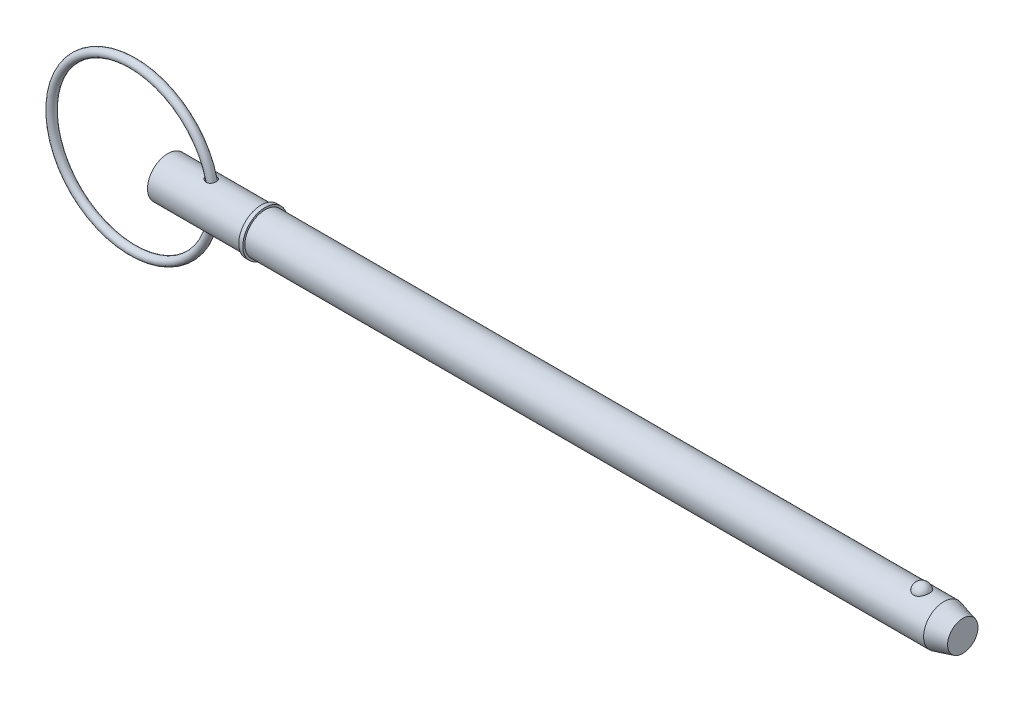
ISO-10303-21;
HEADER;
FILE_DESCRIPTION(('STEP AP214'),'2;1');
FILE_NAME('part.step','',(''),(''),'','','');
FILE_SCHEMA(('AUTOMOTIVE_DESIGN { 1 0 10303 214 1 1 1 1 }'));
ENDSEC;
DATA;
#1=APPLICATION_CONTEXT('core data for automotive mechanical design processes');
#2=APPLICATION_PROTOCOL_DEFINITION('international standard','automotive_design',2000,#1);
#3=PRODUCT_CONTEXT('',#1,'mechanical');
#4=PRODUCT('Part','Part','',(#3));
#5=PRODUCT_RELATED_PRODUCT_CATEGORY('part','',(#4));
#6=PRODUCT_DEFINITION_FORMATION('','',#4);
#7=PRODUCT_DEFINITION_CONTEXT('part definition',#1,'design');
#8=PRODUCT_DEFINITION('design','',#6,#7);
#9=PRODUCT_DEFINITION_SHAPE('','',#8);
#10=(LENGTH_UNIT() NAMED_UNIT(*) SI_UNIT(.MILLI.,.METRE.));
#11=(NAMED_UNIT(*) PLANE_ANGLE_UNIT() SI_UNIT($,.RADIAN.));
#12=(NAMED_UNIT(*) SI_UNIT($,.STERADIAN.) SOLID_ANGLE_UNIT());
#13=UNCERTAINTY_MEASURE_WITH_UNIT(LENGTH_MEASURE(1.E-05),#10,'distance_accuracy_value','');
#14=(GEOMETRIC_REPRESENTATION_CONTEXT(3) GLOBAL_UNCERTAINTY_ASSIGNED_CONTEXT((#13)) GLOBAL_UNIT_ASSIGNED_CONTEXT((#10,
#11,#12)) REPRESENTATION_CONTEXT('',''));
#15=CARTESIAN_POINT('',(0.,0.,0.));
#16=DIRECTION('',(0.,0.,1.));
#17=DIRECTION('',(1.,0.,0.));
#18=AXIS2_PLACEMENT_3D('',#15,#16,#17);
#19=CARTESIAN_POINT('',(-6.86864682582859,0.,0.));
#20=DIRECTION('',(0.,0.,1.));
#21=DIRECTION('',(1.,0.,0.));
#22=AXIS2_PLACEMENT_3D('',#19,#20,#21);
#23=TOROIDAL_SURFACE('',#22,15.875,0.794);
#24=CARTESIAN_POINT('',(9.80035317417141,0.,0.));
#25=VERTEX_POINT('',#24);
#26=VERTEX_LOOP('',#25);
#27=FACE_BOUND('',#26,.T.);
#28=ADVANCED_FACE('P0_F12',(#27),#23,.T.);
#29=CLOSED_SHELL('',(#28));
#30=MANIFOLD_SOLID_BREP('P0_B1',#29);
#31=CARTESIAN_POINT('',(0.,0.,0.));
#32=DIRECTION('',(1.,0.,0.));
#33=DIRECTION('',(0.,0.,-1.));
#34=AXIS2_PLACEMENT_3D('',#31,#32,#33);
#35=CYLINDRICAL_SURFACE('',#34,3.97);
#36=CARTESIAN_POINT('',(7.49679817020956,3.96502331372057,-0.198721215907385));
#37=CARTESIAN_POINT('',(7.50881508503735,3.96235594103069,-0.251916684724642));
#38=CARTESIAN_POINT('',(7.52561550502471,3.95866151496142,-0.304017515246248));
#39=CARTESIAN_POINT('',(7.56786984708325,3.9496659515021,-0.40447153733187));
#40=CARTESIAN_POINT('',(7.59333797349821,3.94436217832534,-0.452818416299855));
#41=CARTESIAN_POINT('',(7.65162192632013,3.93277091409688,-0.544364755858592));
#42=CARTESIAN_POINT('',(7.68440149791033,3.92648832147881,-0.587588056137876));
#43=CARTESIAN_POINT('',(7.75622109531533,3.91354812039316,-0.668369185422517));
#44=CARTESIAN_POINT('',(7.79526077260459,3.90689053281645,-0.705927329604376));
#45=CARTESIAN_POINT('',(7.88192852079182,3.8932854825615,-0.777603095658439));
#46=CARTESIAN_POINT('',(7.92999678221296,3.88635845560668,-0.811192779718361));
#47=CARTESIAN_POINT('',(8.03094744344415,3.87352417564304,-0.870420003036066));
#48=CARTESIAN_POINT('',(8.08383192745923,3.86761736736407,-0.896054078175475));
#49=CARTESIAN_POINT('',(8.19632733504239,3.85719062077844,-0.939958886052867));
#50=CARTESIAN_POINT('',(8.25615064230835,3.85277154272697,-0.957713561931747));
#51=CARTESIAN_POINT('',(8.37807849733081,3.84644428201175,-0.982821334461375));
#52=CARTESIAN_POINT('',(8.44018249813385,3.84453550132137,-0.990176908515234));
#53=CARTESIAN_POINT('',(8.56256649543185,3.84359535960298,-0.993820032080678));
#54=CARTESIAN_POINT('',(8.62283390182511,3.84446524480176,-0.990487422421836));
#55=CARTESIAN_POINT('',(8.74175397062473,3.84884648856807,-0.973323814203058));
#56=CARTESIAN_POINT('',(8.8004073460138,3.85235666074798,-0.959497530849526));
#57=CARTESIAN_POINT('',(8.91034168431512,3.86130428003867,-0.922798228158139));
#58=CARTESIAN_POINT('',(8.96185380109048,3.86659969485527,-0.900580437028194));
#59=CARTESIAN_POINT('',(9.06016940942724,3.87853590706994,-0.847697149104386));
#60=CARTESIAN_POINT('',(9.10697344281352,3.88517654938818,-0.817032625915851));
#61=CARTESIAN_POINT('',(9.19340982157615,3.89885483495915,-0.748999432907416));
#62=CARTESIAN_POINT('',(9.23319345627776,3.90587821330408,-0.711819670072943));
#63=CARTESIAN_POINT('',(9.30598310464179,3.91969783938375,-0.631295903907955));
#64=CARTESIAN_POINT('',(9.33898892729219,3.92649408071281,-0.587951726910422));
#65=CARTESIAN_POINT('',(9.39769437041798,3.939185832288,-0.495874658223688));
#66=CARTESIAN_POINT('',(9.42332322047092,3.94507238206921,-0.447095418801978));
#67=CARTESIAN_POINT('',(9.46625710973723,3.9552342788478,-0.345845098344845));
#68=CARTESIAN_POINT('',(9.48356178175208,3.95950955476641,-0.293373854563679));
#69=CARTESIAN_POINT('',(9.50956700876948,3.96602451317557,-0.185698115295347));
#70=CARTESIAN_POINT('',(9.51818595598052,3.96824487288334,-0.13047272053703));
#71=CARTESIAN_POINT('',(9.52633336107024,3.97034220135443,-0.0193113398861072));
#72=CARTESIAN_POINT('',(9.52586171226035,3.97021914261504,0.0366246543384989));
#73=CARTESIAN_POINT('',(9.51583327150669,3.9676413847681,0.147685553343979));
#74=CARTESIAN_POINT('',(9.50626624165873,3.96518405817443,0.202809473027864));
#75=CARTESIAN_POINT('',(9.47825604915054,3.95819854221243,0.310618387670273));
#76=CARTESIAN_POINT('',(9.45981267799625,3.95367030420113,0.36330332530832));
#77=CARTESIAN_POINT('',(9.41448405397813,3.94303435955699,0.464739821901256));
#78=CARTESIAN_POINT('',(9.38759833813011,3.93692656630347,0.51349116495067));
#79=CARTESIAN_POINT('',(9.32603556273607,3.92380455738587,0.605663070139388));
#80=CARTESIAN_POINT('',(9.29135869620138,3.91679036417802,0.649083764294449));
#81=CARTESIAN_POINT('',(9.21526329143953,3.90267522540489,0.729160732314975));
#82=CARTESIAN_POINT('',(9.17387556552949,3.89557480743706,0.765846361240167));
#83=CARTESIAN_POINT('',(9.08536362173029,3.88206315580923,0.831635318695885));
#84=CARTESIAN_POINT('',(9.03824022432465,3.8756518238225,0.860739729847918));
#85=CARTESIAN_POINT('',(8.94022154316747,3.86431915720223,0.910262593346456));
#86=CARTESIAN_POINT('',(8.88938101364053,3.85938013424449,0.930785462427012));
#87=CARTESIAN_POINT('',(8.78488780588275,3.85141510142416,0.96321476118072));
#88=CARTESIAN_POINT('',(8.73123520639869,3.84838903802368,0.975121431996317));
#89=CARTESIAN_POINT('',(8.62249427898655,3.84453017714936,0.990226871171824));
#90=CARTESIAN_POINT('',(8.56740225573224,3.84370373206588,0.993400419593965));
#91=CARTESIAN_POINT('',(8.45741104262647,3.8442816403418,0.991160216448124));
#92=CARTESIAN_POINT('',(8.40251189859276,3.84568649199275,0.98574454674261));
#93=CARTESIAN_POINT('',(8.29176880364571,3.85062289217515,0.966285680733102));
#94=CARTESIAN_POINT('',(8.23599684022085,3.85424894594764,0.951858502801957));
#95=CARTESIAN_POINT('',(8.12747212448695,3.86325492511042,0.91461785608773));
#96=CARTESIAN_POINT('',(8.0747205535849,3.86863553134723,0.891801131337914));
#97=CARTESIAN_POINT('',(7.97015235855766,3.88095261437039,0.836633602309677));
#98=CARTESIAN_POINT('',(7.91862083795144,3.88796764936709,0.803758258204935));
#99=CARTESIAN_POINT('',(7.82179253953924,3.90250904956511,0.729888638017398));
#100=CARTESIAN_POINT('',(7.77649765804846,3.91003556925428,0.688891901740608));
#101=CARTESIAN_POINT('',(7.69332536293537,3.92478114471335,0.599225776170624));
#102=CARTESIAN_POINT('',(7.6555122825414,3.93199714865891,0.550495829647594));
#103=CARTESIAN_POINT('',(7.5894819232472,3.94512912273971,0.446741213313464));
#104=CARTESIAN_POINT('',(7.56125849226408,3.95104592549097,0.391720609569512));
#105=CARTESIAN_POINT('',(7.51806227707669,3.9603062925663,0.282172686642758));
#106=CARTESIAN_POINT('',(7.50213211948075,3.96383230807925,0.228039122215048));
#107=CARTESIAN_POINT('',(7.48057398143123,3.96863642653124,0.117706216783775));
#108=CARTESIAN_POINT('',(7.47492746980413,3.96991857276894,0.0615107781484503));
#109=CARTESIAN_POINT('',(7.47437932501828,3.97004395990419,-0.0289758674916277));
#110=CARTESIAN_POINT('',(7.47615129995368,3.96964216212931,-0.0632805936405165));
#111=CARTESIAN_POINT('',(7.48358566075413,3.96796978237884,-0.131441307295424));
#112=CARTESIAN_POINT('',(7.48924767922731,3.96669928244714,-0.165297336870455));
#113=CARTESIAN_POINT('',(7.49679817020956,3.96502331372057,-0.198721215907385));
#114=B_SPLINE_CURVE_WITH_KNOTS('',3,(#36,#37,#38,#39,#40,#41,#42,#43,#44,#45,#46,#47,#48,#49,
#50,#51,#52,#53,#54,#55,#56,#57,#58,#59,#60,#61,#62,#63,#64,#65,#66,#67,#68,#69,#70,#71,#72,#73,
#74,#75,#76,#77,#78,#79,#80,#81,#82,#83,#84,#85,#86,#87,#88,#89,#90,#91,#92,#93,#94,#95,#96,#97,
#98,#99,#100,#101,#102,#103,#104,#105,#106,#107,#108,#109,#110,#111,#112,#113),.UNSPECIFIED.,
.T.,.F.,(4,2,2,2,2,2,2,2,2,2,2,2,2,2,2,2,2,2,2,2,2,2,2,2,2,2,2,2,2,2,2,2,2,2,2,2,2,2,4),(0.,
0.163661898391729,0.327593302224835,0.490729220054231,0.653856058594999,0.830244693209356,
1.00671002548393,1.1934572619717,1.38016000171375,1.56030212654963,1.74036335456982,
1.90857505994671,2.07676738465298,2.24071128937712,2.40465981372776,2.57013239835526,
2.73561228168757,2.90263284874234,3.06965537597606,3.23686612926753,3.40408081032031,
3.5713046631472,3.73852437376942,3.90499698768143,4.07144581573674,4.2358058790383,
4.40016134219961,4.56499094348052,4.72985735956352,4.90227873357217,5.0747670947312,
5.25849939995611,5.44228744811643,5.62759301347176,5.81277947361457,5.98144776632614,
6.14981181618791,6.25265388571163,6.35548624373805),.UNSPECIFIED.);
#115=CARTESIAN_POINT('',(7.49679817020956,3.96502331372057,-0.198721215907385));
#116=VERTEX_POINT('',#115);
#117=EDGE_CURVE('P1_E42',#116,#116,#114,.T.);
#118=ORIENTED_EDGE('',*,*,#117,.T.);
#119=EDGE_LOOP('',(#118));
#120=FACE_BOUND('',#119,.T.);
#121=CARTESIAN_POINT('',(0.,0.,0.));
#122=DIRECTION('',(1.,0.,0.));
#123=DIRECTION('',(0.,0.,-1.));
#124=AXIS2_PLACEMENT_3D('',#121,#122,#123);
#125=CIRCLE('',#124,3.97);
#126=CARTESIAN_POINT('',(0.,0.,-3.97));
#127=VERTEX_POINT('',#126);
#128=EDGE_CURVE('P1_E9',#127,#127,#125,.T.);
#129=ORIENTED_EDGE('',*,*,#128,.T.);
#130=EDGE_LOOP('',(#129));
#131=FACE_BOUND('',#130,.T.);
#132=CARTESIAN_POINT('',(18.256,0.,0.));
#133=DIRECTION('',(1.,0.,0.));
#134=DIRECTION('',(0.,0.,-1.));
#135=AXIS2_PLACEMENT_3D('',#132,#133,#134);
#136=CIRCLE('',#135,3.97);
#137=CARTESIAN_POINT('',(18.256,0.,-3.97));
#138=VERTEX_POINT('',#137);
#139=EDGE_CURVE('P1_E25',#138,#138,#136,.T.);
#140=ORIENTED_EDGE('',*,*,#139,.F.);
#141=EDGE_LOOP('',(#140));
#142=FACE_BOUND('',#141,.T.);
#143=CARTESIAN_POINT('',(7.49679817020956,-3.96502331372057,-0.198721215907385));
#144=CARTESIAN_POINT('',(7.48580986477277,-3.96746179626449,-0.150065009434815));
#145=CARTESIAN_POINT('',(7.47881617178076,-3.96904213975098,-0.100459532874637));
#146=CARTESIAN_POINT('',(7.47318383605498,-3.97031279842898,-0.000748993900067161));
#147=CARTESIAN_POINT('',(7.47454464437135,-3.97000323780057,0.049356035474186));
#148=CARTESIAN_POINT('',(7.48554252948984,-3.9675299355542,0.148550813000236));
#149=CARTESIAN_POINT('',(7.49517270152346,-3.9653677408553,0.197641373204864));
#150=CARTESIAN_POINT('',(7.5222068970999,-3.95942609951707,0.293523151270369));
#151=CARTESIAN_POINT('',(7.53961293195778,-3.9556462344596,0.340313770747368));
#152=CARTESIAN_POINT('',(7.58186218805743,-3.946757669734,0.431446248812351));
#153=CARTESIAN_POINT('',(7.6068526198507,-3.94162295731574,0.475716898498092));
#154=CARTESIAN_POINT('',(7.66318857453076,-3.93055115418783,0.559886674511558));
#155=CARTESIAN_POINT('',(7.69453617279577,-3.92461380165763,0.599784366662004));
#156=CARTESIAN_POINT('',(7.76618955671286,-3.91181958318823,0.678467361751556));
#157=CARTESIAN_POINT('',(7.80708710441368,-3.90493119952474,0.716708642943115));
#158=CARTESIAN_POINT('',(7.89431870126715,-3.89148185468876,0.786469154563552));
#159=CARTESIAN_POINT('',(7.94065563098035,-3.88492106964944,0.817984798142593));
#160=CARTESIAN_POINT('',(8.04208221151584,-3.87221514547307,0.876253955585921));
#161=CARTESIAN_POINT('',(8.09758465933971,-3.8661622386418,0.902312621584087));
#162=CARTESIAN_POINT('',(8.21228401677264,-3.855952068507,0.944996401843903));
#163=CARTESIAN_POINT('',(8.27148128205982,-3.85179498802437,0.961620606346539));
#164=CARTESIAN_POINT('',(8.39228716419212,-3.84593851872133,0.984786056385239));
#165=CARTESIAN_POINT('',(8.45390693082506,-3.84425231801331,0.991273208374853));
#166=CARTESIAN_POINT('',(8.57734686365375,-3.84370168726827,0.993408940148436));
#167=CARTESIAN_POINT('',(8.63916691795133,-3.84483588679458,0.989062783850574));
#168=CARTESIAN_POINT('',(8.75703619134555,-3.84970227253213,0.969937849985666));
#169=CARTESIAN_POINT('',(8.81320274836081,-3.85326512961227,0.955838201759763));
#170=CARTESIAN_POINT('',(8.92207486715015,-3.8624204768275,0.918140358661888));
#171=CARTESIAN_POINT('',(8.97478130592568,-3.86801245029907,0.89454458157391));
#172=CARTESIAN_POINT('',(9.07264210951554,-3.88024902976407,0.83982747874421));
#173=CARTESIAN_POINT('',(9.11803751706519,-3.88683023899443,0.809121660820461));
#174=CARTESIAN_POINT('',(9.20292513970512,-3.90048324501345,0.740506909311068));
#175=CARTESIAN_POINT('',(9.24241747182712,-3.90755503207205,0.702598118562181));
#176=CARTESIAN_POINT('',(9.31440361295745,-3.92139192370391,0.620727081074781));
#177=CARTESIAN_POINT('',(9.34691105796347,-3.9281576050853,0.576776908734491));
#178=CARTESIAN_POINT('',(9.40424150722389,-3.94066521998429,0.483990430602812));
#179=CARTESIAN_POINT('',(9.4290641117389,-3.94640710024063,0.435153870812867));
#180=CARTESIAN_POINT('',(9.47070060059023,-3.95631713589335,0.333318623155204));
#181=CARTESIAN_POINT('',(9.48741220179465,-3.96046506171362,0.280276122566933));
#182=CARTESIAN_POINT('',(9.51197570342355,-3.9666399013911,0.172058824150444));
#183=CARTESIAN_POINT('',(9.5198274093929,-3.96866676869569,0.116883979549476));
#184=CARTESIAN_POINT('',(9.52650209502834,-3.9703865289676,0.00572427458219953));
#185=CARTESIAN_POINT('',(9.52528754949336,-3.97006972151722,-0.0502629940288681));
#186=CARTESIAN_POINT('',(9.51376883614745,-3.96711300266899,-0.161232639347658));
#187=CARTESIAN_POINT('',(9.50346452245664,-3.96447305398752,-0.216214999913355));
#188=CARTESIAN_POINT('',(9.47400716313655,-3.95715440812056,-0.323616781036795));
#189=CARTESIAN_POINT('',(9.45485370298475,-3.95247561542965,-0.376036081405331));
#190=CARTESIAN_POINT('',(9.40815019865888,-3.94158766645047,-0.47682082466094));
#191=CARTESIAN_POINT('',(9.38060003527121,-3.93537848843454,-0.525186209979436));
#192=CARTESIAN_POINT('',(9.31780916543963,-3.92212278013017,-0.616423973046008));
#193=CARTESIAN_POINT('',(9.28257772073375,-3.91507726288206,-0.659302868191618));
#194=CARTESIAN_POINT('',(9.20530256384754,-3.90093459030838,-0.738394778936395));
#195=CARTESIAN_POINT('',(9.16325952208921,-3.8938374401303,-0.774608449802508));
#196=CARTESIAN_POINT('',(9.07394283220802,-3.88046830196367,-0.83901178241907));
#197=CARTESIAN_POINT('',(9.02672460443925,-3.87418889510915,-0.867276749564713));
#198=CARTESIAN_POINT('',(8.92806876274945,-3.86308015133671,-0.915492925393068));
#199=CARTESIAN_POINT('',(8.87663164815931,-3.85825064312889,-0.935445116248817));
#200=CARTESIAN_POINT('',(8.77150354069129,-3.85059630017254,-0.966469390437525));
#201=CARTESIAN_POINT('',(8.71783614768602,-3.84775433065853,-0.977617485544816));
#202=CARTESIAN_POINT('',(8.60934883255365,-3.84426767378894,-0.991239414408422));
#203=CARTESIAN_POINT('',(8.55452877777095,-3.84362324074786,-0.993712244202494));
#204=CARTESIAN_POINT('',(8.4438244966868,-3.84454392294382,-0.990144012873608));
#205=CARTESIAN_POINT('',(8.3879479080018,-3.84616465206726,-0.983888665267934));
#206=CARTESIAN_POINT('',(8.27791058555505,-3.85146784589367,-0.962917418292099));
#207=CARTESIAN_POINT('',(8.22375037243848,-3.85515092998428,-0.948198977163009));
#208=CARTESIAN_POINT('',(8.11503410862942,-3.86443542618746,-0.90964598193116));
#209=CARTESIAN_POINT('',(8.06067129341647,-3.87014379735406,-0.885291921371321));
#210=CARTESIAN_POINT('',(7.95661263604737,-3.88274545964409,-0.828274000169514));
#211=CARTESIAN_POINT('',(7.90691941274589,-3.88963940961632,-0.795605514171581));
#212=CARTESIAN_POINT('',(7.81143608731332,-3.90417480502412,-0.720990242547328));
#213=CARTESIAN_POINT('',(7.76592225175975,-3.9118359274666,-0.678692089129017));
#214=CARTESIAN_POINT('',(7.68309200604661,-3.926691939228,-0.586646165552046));
#215=CARTESIAN_POINT('',(7.6457689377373,-3.93388720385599,-0.536904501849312));
#216=CARTESIAN_POINT('',(7.58649683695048,-3.94577687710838,-0.440118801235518));
#217=CARTESIAN_POINT('',(7.56301593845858,-3.95068841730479,-0.394037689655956));
#218=CARTESIAN_POINT('',(7.52386335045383,-3.95904753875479,-0.298549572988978));
#219=CARTESIAN_POINT('',(7.5081856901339,-3.96249623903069,-0.249145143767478));
#220=CARTESIAN_POINT('',(7.49679817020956,-3.96502331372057,-0.198721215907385));
#221=B_SPLINE_CURVE_WITH_KNOTS('',3,(#143,#144,#145,#146,#147,#148,#149,#150,#151,#152,#153,
#154,#155,#156,#157,#158,#159,#160,#161,#162,#163,#164,#165,#166,#167,#168,#169,#170,#171,#172,
#173,#174,#175,#176,#177,#178,#179,#180,#181,#182,#183,#184,#185,#186,#187,#188,#189,#190,#191,
#192,#193,#194,#195,#196,#197,#198,#199,#200,#201,#202,#203,#204,#205,#206,#207,#208,#209,#210,
#211,#212,#213,#214,#215,#216,#217,#218,#219,#220),.UNSPECIFIED.,.T.,.F.,(4,2,2,2,2,2,2,2,2,2,2,
2,2,2,2,2,2,2,2,2,2,2,2,2,2,2,2,2,2,2,2,2,2,2,2,2,2,2,4),(0.,0.149644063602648,
0.299278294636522,0.448787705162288,0.598335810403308,0.750995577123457,0.903705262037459,
1.07224475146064,1.2408739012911,1.4248565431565,1.60885692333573,1.79383585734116,
1.97872492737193,2.15188813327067,2.32500727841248,2.489818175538,2.65462580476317,
2.81910871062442,2.98360017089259,3.15011526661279,3.31663401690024,3.48384236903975,
3.65105340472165,3.81827227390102,3.98549351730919,4.15251423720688,4.31951852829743,
4.48488279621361,4.65022752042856,4.81412860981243,4.97804866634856,5.14606470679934,
5.31413123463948,5.49286956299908,5.67170754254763,5.85859317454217,6.0453263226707,
6.20052601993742,6.35560677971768),.UNSPECIFIED.);
#222=CARTESIAN_POINT('',(7.49679817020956,-3.96502331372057,-0.198721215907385));
#223=VERTEX_POINT('',#222);
#224=EDGE_CURVE('P1_E17',#223,#223,#221,.T.);
#225=ORIENTED_EDGE('',*,*,#224,.T.);
#226=EDGE_LOOP('',(#225));
#227=FACE_BOUND('',#226,.T.);
#228=ADVANCED_FACE('P1_F13',(#120,#131,#142,#227),#35,.T.);
#229=CARTESIAN_POINT('',(0.,0.,0.));
#230=DIRECTION('',(1.,0.,0.));
#231=DIRECTION('',(0.,0.,-1.));
#232=AXIS2_PLACEMENT_3D('',#229,#230,#231);
#233=CYLINDRICAL_SURFACE('',#232,3.97);
#234=CARTESIAN_POINT('',(151.875939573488,0.,0.));
#235=DIRECTION('',(1.,0.,0.));
#236=DIRECTION('',(0.,0.,-1.));
#237=AXIS2_PLACEMENT_3D('',#234,#235,#236);
#238=CIRCLE('',#237,3.97);
#239=CARTESIAN_POINT('',(151.875939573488,0.,-3.97));
#240=VERTEX_POINT('',#239);
#241=EDGE_CURVE('P1_E99',#240,#240,#238,.T.);
#242=ORIENTED_EDGE('',*,*,#241,.F.);
#243=EDGE_LOOP('',(#242));
#244=FACE_BOUND('',#243,.T.);
#245=CARTESIAN_POINT('',(19.05,0.,0.));
#246=DIRECTION('',(1.,0.,0.));
#247=DIRECTION('',(0.,0.,-1.));
#248=AXIS2_PLACEMENT_3D('',#245,#246,#247);
#249=CIRCLE('',#248,3.97);
#250=CARTESIAN_POINT('',(19.05,0.,-3.97));
#251=VERTEX_POINT('',#250);
#252=EDGE_CURVE('P1_E96',#251,#251,#249,.T.);
#253=ORIENTED_EDGE('',*,*,#252,.T.);
#254=EDGE_LOOP('',(#253));
#255=FACE_BOUND('',#254,.T.);
#256=CARTESIAN_POINT('',(147.545192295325,3.65715365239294,1.54470941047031));
#257=CARTESIAN_POINT('',(147.465244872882,3.65716001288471,1.54470290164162));
#258=CARTESIAN_POINT('',(147.385165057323,3.65987074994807,1.53832549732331));
#259=CARTESIAN_POINT('',(147.227237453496,3.67042218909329,1.51297018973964));
#260=CARTESIAN_POINT('',(147.14939614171,3.67827646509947,1.4939589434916));
#261=CARTESIAN_POINT('',(146.998461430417,3.69818848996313,1.4439595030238));
#262=CARTESIAN_POINT('',(146.925356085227,3.71023513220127,1.41300293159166));
#263=CARTESIAN_POINT('',(146.785563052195,3.7372183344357,1.34000212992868));
#264=CARTESIAN_POINT('',(146.718872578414,3.75215363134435,1.29796274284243));
#265=CARTESIAN_POINT('',(146.59148864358,3.78384968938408,1.20248834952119));
#266=CARTESIAN_POINT('',(146.531029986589,3.800651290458,1.14875388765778));
#267=CARTESIAN_POINT('',(146.419694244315,3.83398532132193,1.03205417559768));
#268=CARTESIAN_POINT('',(146.368820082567,3.85051766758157,0.969086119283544));
#269=CARTESIAN_POINT('',(146.275632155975,3.88238608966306,0.832526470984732));
#270=CARTESIAN_POINT('',(146.233796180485,3.89763698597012,0.758588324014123));
#271=CARTESIAN_POINT('',(146.162510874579,3.92451063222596,0.604352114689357));
#272=CARTESIAN_POINT('',(146.133062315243,3.93613315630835,0.524053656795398));
#273=CARTESIAN_POINT('',(146.086892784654,3.95467606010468,0.358403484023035));
#274=CARTESIAN_POINT('',(146.070312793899,3.96154426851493,0.273006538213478));
#275=CARTESIAN_POINT('',(146.050756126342,3.96967008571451,0.100408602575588));
#276=CARTESIAN_POINT('',(146.047778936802,3.97092790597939,0.0132076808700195));
#277=CARTESIAN_POINT('',(146.055458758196,3.96771794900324,-0.159844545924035));
#278=CARTESIAN_POINT('',(146.066016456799,3.96329187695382,-0.245701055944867));
#279=CARTESIAN_POINT('',(146.10038009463,3.94923163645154,-0.414277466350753));
#280=CARTESIAN_POINT('',(146.124186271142,3.93959737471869,-0.496997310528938));
#281=CARTESIAN_POINT('',(146.18461142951,3.91607752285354,-0.657113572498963));
#282=CARTESIAN_POINT('',(146.221249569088,3.90218558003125,-0.734501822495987));
#283=CARTESIAN_POINT('',(146.306593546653,3.87158287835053,-0.881704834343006));
#284=CARTESIAN_POINT('',(146.355300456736,3.85487186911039,-0.951518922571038));
#285=CARTESIAN_POINT('',(146.464116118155,3.82028735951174,-1.08208159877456));
#286=CARTESIAN_POINT('',(146.524295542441,3.80240713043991,-1.14276958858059));
#287=CARTESIAN_POINT('',(146.654493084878,3.76758161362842,-1.25282437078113));
#288=CARTESIAN_POINT('',(146.724510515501,3.75063626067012,-1.30219195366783));
#289=CARTESIAN_POINT('',(146.87118160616,3.71998948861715,-1.38729709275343));
#290=CARTESIAN_POINT('',(146.947681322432,3.70623183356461,-1.42327904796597));
#291=CARTESIAN_POINT('',(147.106298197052,3.68323188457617,-1.48178996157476));
#292=CARTESIAN_POINT('',(147.1884132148,3.67398788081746,-1.50432401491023));
#293=CARTESIAN_POINT('',(147.351481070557,3.66152163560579,-1.53440939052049));
#294=CARTESIAN_POINT('',(147.432284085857,3.65801951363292,-1.54265826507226));
#295=CARTESIAN_POINT('',(147.59420850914,3.65657341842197,-1.54608423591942));
#296=CARTESIAN_POINT('',(147.675329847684,3.65862829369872,-1.54126404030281));
#297=CARTESIAN_POINT('',(147.832812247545,3.66788969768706,-1.5190847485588));
#298=CARTESIAN_POINT('',(147.909242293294,3.67492621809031,-1.50213925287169));
#299=CARTESIAN_POINT('',(148.058041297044,3.69318404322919,-1.4566698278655));
#300=CARTESIAN_POINT('',(148.130409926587,3.7044056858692,-1.42814496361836));
#301=CARTESIAN_POINT('',(148.270802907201,3.73012749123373,-1.35956319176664));
#302=CARTESIAN_POINT('',(148.338700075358,3.74469307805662,-1.31927107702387));
#303=CARTESIAN_POINT('',(148.466864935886,3.77545272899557,-1.22847440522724));
#304=CARTESIAN_POINT('',(148.527130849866,3.79164717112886,-1.1779674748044));
#305=CARTESIAN_POINT('',(148.641634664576,3.82490325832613,-1.06519260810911));
#306=CARTESIAN_POINT('',(148.695413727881,3.84196735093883,-1.00245914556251));
#307=CARTESIAN_POINT('',(148.792098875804,3.87439863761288,-0.86871586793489));
#308=CARTESIAN_POINT('',(148.835003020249,3.88976552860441,-0.797704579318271));
#309=CARTESIAN_POINT('',(148.910266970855,3.91771381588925,-0.646896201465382));
#310=CARTESIAN_POINT('',(148.94225322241,3.93019255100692,-0.566893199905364));
#311=CARTESIAN_POINT('',(148.993110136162,3.95043886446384,-0.402255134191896));
#312=CARTESIAN_POINT('',(149.011980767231,3.95820643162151,-0.317620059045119));
#313=CARTESIAN_POINT('',(149.03621625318,3.96823733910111,-0.146156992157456));
#314=CARTESIAN_POINT('',(149.041587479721,3.970503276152,-0.0593300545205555));
#315=CARTESIAN_POINT('',(149.038730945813,3.96930811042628,0.114057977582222));
#316=CARTESIAN_POINT('',(149.030503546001,3.9658471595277,0.200619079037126));
#317=CARTESIAN_POINT('',(149.000706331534,3.95358562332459,0.370506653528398));
#318=CARTESIAN_POINT('',(148.97921294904,3.94481563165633,0.453848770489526));
#319=CARTESIAN_POINT('',(148.92338397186,3.92284586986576,0.615497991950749));
#320=CARTESIAN_POINT('',(148.889047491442,3.90964579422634,0.693804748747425));
#321=CARTESIAN_POINT('',(148.807970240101,3.88006987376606,0.843703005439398));
#322=CARTESIAN_POINT('',(148.761153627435,3.86367478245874,0.915249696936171));
#323=CARTESIAN_POINT('',(148.656189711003,3.82949741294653,1.04910810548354));
#324=CARTESIAN_POINT('',(148.598042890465,3.81171519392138,1.11142021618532));
#325=CARTESIAN_POINT('',(148.471743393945,3.7767336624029,1.22503948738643));
#326=CARTESIAN_POINT('',(148.403597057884,3.75953398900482,1.27635357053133));
#327=CARTESIAN_POINT('',(148.258900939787,3.72770506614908,1.36653336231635));
#328=CARTESIAN_POINT('',(148.182348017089,3.7130767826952,1.4053943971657));
#329=CARTESIAN_POINT('',(148.025759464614,3.68864287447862,1.46830480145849));
#330=CARTESIAN_POINT('',(147.945930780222,3.67869017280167,1.49281289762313));
#331=CARTESIAN_POINT('',(147.782987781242,3.66414535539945,1.52817474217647));
#332=CARTESIAN_POINT('',(147.699884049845,3.65953723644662,1.53906926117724));
#333=CARTESIAN_POINT('',(147.592776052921,3.65738948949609,1.54414878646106));
#334=CARTESIAN_POINT('',(147.568990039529,3.65715175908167,1.54471134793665));
#335=CARTESIAN_POINT('',(147.545192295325,3.65715365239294,1.54470941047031));
#336=B_SPLINE_CURVE_WITH_KNOTS('',3,(#256,#257,#258,#259,#260,#261,#262,#263,#264,#265,#266,
#267,#268,#269,#270,#271,#272,#273,#274,#275,#276,#277,#278,#279,#280,#281,#282,#283,#284,#285,
#286,#287,#288,#289,#290,#291,#292,#293,#294,#295,#296,#297,#298,#299,#300,#301,#302,#303,#304,
#305,#306,#307,#308,#309,#310,#311,#312,#313,#314,#315,#316,#317,#318,#319,#320,#321,#322,#323,
#324,#325,#326,#327,#328,#329,#330,#331,#332,#333,#334,#335),.UNSPECIFIED.,.T.,.F.,(4,2,2,2,2,2,
2,2,2,2,2,2,2,2,2,2,2,2,2,2,2,2,2,2,2,2,2,2,2,2,2,2,2,2,2,2,2,2,2,4),(0.,0.239777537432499,
0.48019041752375,0.719971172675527,0.9596473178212,1.20639040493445,1.45320863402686,
1.71093679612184,1.9686809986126,2.22921052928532,2.48973023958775,2.74834928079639,
3.00697295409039,3.26598440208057,3.52501886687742,3.78570385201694,4.04637062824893,
4.30201257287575,4.55755760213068,4.80022994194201,5.04285200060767,5.27757006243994,
5.51230707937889,5.75210128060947,5.99195126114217,6.24392810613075,6.49594987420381,
6.75588818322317,7.01582710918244,7.2756433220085,7.53545264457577,7.79377886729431,
8.05212290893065,8.31207418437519,8.57201437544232,8.83179046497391,9.09166393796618,
9.3427005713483,9.59298357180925,9.66435753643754),.UNSPECIFIED.);
#337=CARTESIAN_POINT('',(147.545192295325,3.65715365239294,1.54470941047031));
#338=VERTEX_POINT('',#337);
#339=EDGE_CURVE('P1_E34',#338,#338,#336,.T.);
#340=ORIENTED_EDGE('',*,*,#339,.T.);
#341=EDGE_LOOP('',(#340));
#342=FACE_BOUND('',#341,.T.);
#343=ADVANCED_FACE('P1_F46',(#244,#255,#342),#233,.T.);
#344=CARTESIAN_POINT('',(0.,0.,0.));
#345=DIRECTION('',(-1.,0.,0.));
#346=DIRECTION('',(0.,0.,1.));
#347=AXIS2_PLACEMENT_3D('',#344,#345,#346);
#348=PLANE('',#347);
#349=ORIENTED_EDGE('',*,*,#128,.F.);
#350=EDGE_LOOP('',(#349));
#351=FACE_BOUND('',#350,.T.);
#352=ADVANCED_FACE('P1_F15',(#351),#348,.T.);
#353=CARTESIAN_POINT('',(18.256,3.97,0.));
#354=DIRECTION('',(-1.,0.,0.));
#355=DIRECTION('',(0.,0.,1.));
#356=AXIS2_PLACEMENT_3D('',#353,#354,#355);
#357=PLANE('',#356);
#358=ORIENTED_EDGE('',*,*,#139,.T.);
#359=EDGE_LOOP('',(#358));
#360=FACE_BOUND('',#359,.T.);
#361=CARTESIAN_POINT('',(18.256,0.,0.));
#362=DIRECTION('',(1.,0.,0.));
#363=DIRECTION('',(0.,0.,-1.));
#364=AXIS2_PLACEMENT_3D('',#361,#362,#363);
#365=CIRCLE('',#364,4.367);
#366=CARTESIAN_POINT('',(18.256,0.,-4.367));
#367=VERTEX_POINT('',#366);
#368=EDGE_CURVE('P1_E30',#367,#367,#365,.T.);
#369=ORIENTED_EDGE('',*,*,#368,.F.);
#370=EDGE_LOOP('',(#369));
#371=FACE_BOUND('',#370,.T.);
#372=ADVANCED_FACE('P1_F81',(#360,#371),#357,.T.);
#373=CARTESIAN_POINT('',(0.,0.,0.));
#374=DIRECTION('',(1.,0.,0.));
#375=DIRECTION('',(0.,0.,-1.));
#376=AXIS2_PLACEMENT_3D('',#373,#374,#375);
#377=CYLINDRICAL_SURFACE('',#376,4.367);
#378=ORIENTED_EDGE('',*,*,#368,.T.);
#379=EDGE_LOOP('',(#378));
#380=FACE_BOUND('',#379,.T.);
#381=CARTESIAN_POINT('',(19.05,0.,0.));
#382=DIRECTION('',(1.,0.,0.));
#383=DIRECTION('',(0.,0.,-1.));
#384=AXIS2_PLACEMENT_3D('',#381,#382,#383);
#385=CIRCLE('',#384,4.367);
#386=CARTESIAN_POINT('',(19.05,0.,-4.367));
#387=VERTEX_POINT('',#386);
#388=EDGE_CURVE('P1_E95',#387,#387,#385,.T.);
#389=ORIENTED_EDGE('',*,*,#388,.F.);
#390=EDGE_LOOP('',(#389));
#391=FACE_BOUND('',#390,.T.);
#392=ADVANCED_FACE('P1_F68',(#380,#391),#377,.T.);
#393=CARTESIAN_POINT('',(19.05,4.367,0.));
#394=DIRECTION('',(1.,0.,0.));
#395=DIRECTION('',(0.,0.,-1.));
#396=AXIS2_PLACEMENT_3D('',#393,#394,#395);
#397=PLANE('',#396);
#398=ORIENTED_EDGE('',*,*,#388,.T.);
#399=EDGE_LOOP('',(#398));
#400=FACE_BOUND('',#399,.T.);
#401=ORIENTED_EDGE('',*,*,#252,.F.);
#402=EDGE_LOOP('',(#401));
#403=FACE_BOUND('',#402,.T.);
#404=ADVANCED_FACE('P1_F62',(#400,#403),#397,.T.);
#405=CARTESIAN_POINT('',(155.58,0.,0.));
#406=DIRECTION('',(-1.,0.,0.));
#407=DIRECTION('',(0.,0.,1.));
#408=AXIS2_PLACEMENT_3D('',#405,#406,#407);
#409=CONICAL_SURFACE('',#408,2.97750000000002,0.261799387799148);
#410=ORIENTED_EDGE('',*,*,#241,.T.);
#411=EDGE_LOOP('',(#410));
#412=FACE_BOUND('',#411,.T.);
#413=CARTESIAN_POINT('',(155.58,0.,0.));
#414=DIRECTION('',(1.,0.,0.));
#415=DIRECTION('',(0.,0.,-1.));
#416=AXIS2_PLACEMENT_3D('',#413,#414,#415);
#417=CIRCLE('',#416,2.97750000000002);
#418=CARTESIAN_POINT('',(155.58,0.,-2.97750000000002));
#419=VERTEX_POINT('',#418);
#420=EDGE_CURVE('P1_E41',#419,#419,#417,.T.);
#421=ORIENTED_EDGE('',*,*,#420,.F.);
#422=EDGE_LOOP('',(#421));
#423=FACE_BOUND('',#422,.T.);
#424=ADVANCED_FACE('P1_F59',(#412,#423),#409,.T.);
#425=CARTESIAN_POINT('',(155.58,2.97750000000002,0.));
#426=DIRECTION('',(1.,0.,0.));
#427=DIRECTION('',(0.,0.,-1.));
#428=AXIS2_PLACEMENT_3D('',#425,#426,#427);
#429=PLANE('',#428);
#430=ORIENTED_EDGE('',*,*,#420,.T.);
#431=EDGE_LOOP('',(#430));
#432=FACE_BOUND('',#431,.T.);
#433=ADVANCED_FACE('P1_F55',(#432),#429,.T.);
#434=CARTESIAN_POINT('',(147.545192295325,3.57299999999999,0.));
#435=DIRECTION('',(-1.,0.,0.));
#436=DIRECTION('',(0.,1.,0.));
#437=AXIS2_PLACEMENT_3D('',#434,#435,#436);
#438=SPHERICAL_SURFACE('',#437,1.54700000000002);
#439=ORIENTED_EDGE('',*,*,#339,.F.);
#440=EDGE_LOOP('',(#439));
#441=FACE_BOUND('',#440,.T.);
#442=ADVANCED_FACE('P1_F50',(#441),#438,.T.);
#443=CARTESIAN_POINT('',(-6.86864682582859,0.,0.));
#444=DIRECTION('',(0.,0.,1.));
#445=DIRECTION('',(1.,0.,0.));
#446=AXIS2_PLACEMENT_3D('',#443,#444,#445);
#447=TOROIDAL_SURFACE('',#446,15.875,0.992500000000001);
#448=ORIENTED_EDGE('',*,*,#224,.F.);
#449=EDGE_LOOP('',(#448));
#450=FACE_BOUND('',#449,.T.);
#451=ORIENTED_EDGE('',*,*,#117,.F.);
#452=EDGE_LOOP('',(#451));
#453=FACE_BOUND('',#452,.T.);
#454=ADVANCED_FACE('P1_F54',(#450,#453),#447,.F.);
#455=CLOSED_SHELL('',(#228,#343,#352,#372,#392,#404,#424,#433,#442,#454));
#456=MANIFOLD_SOLID_BREP('P1_B1',#455);
#457=ADVANCED_BREP_SHAPE_REPRESENTATION('',(#18,#30,#456),#14);
#458=SHAPE_DEFINITION_REPRESENTATION(#9,#457);
ENDSEC;
END-ISO-10303-21;
